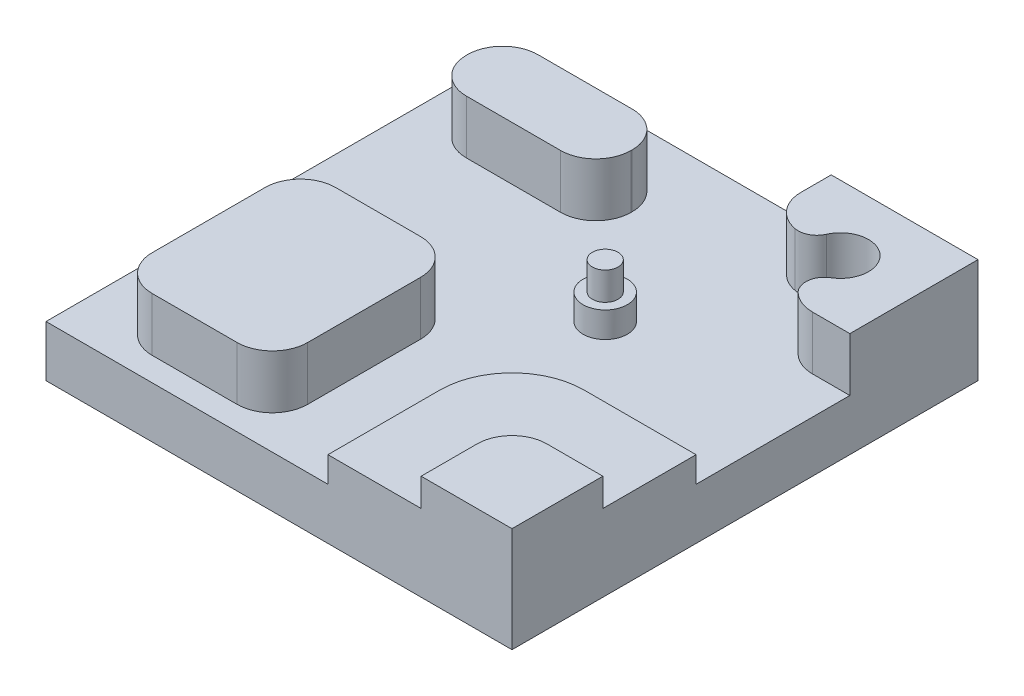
from build123d import *

# Parameters (mm, degrees)
SKETCH1_W           = 50
SKETCH1_H           = 50
BOSS_EXTRUDE1_DEPTH = 5.5
SKETCH2_W           = 9.75
SKETCH2_H           = 9.75
BOSS_EXTRUDE2_DEPTH = 5.75
SKETCH3_W           = 19.75
SKETCH3_H           = 19.75
BOSS_EXTRUDE3_DEPTH = 2.75
FILLET1_R           = 3.75
SKETCH4_W           = 15.75
SKETCH4_H           = 7
BOSS_EXTRUDE4_DEPTH = 5.75
SKETCH5_W           = 7.75
SKETCH5_H           = 6.75
BOSS_EXTRUDE5_DEPTH = 5.75
FILLET2_R           = 3.75
SKETCH6_W           = 16.69
SKETCH6_H           = 19.69
BOSS_EXTRUDE6_DEPTH = 5.75
FILLET3_R           = 3.79
SKETCH7_W           = 17.69
SKETCH7_H           = 7.69
BOSS_EXTRUDE7_DEPTH = 5.75
FILLET4_R           = 3.79
SKETCH8_R           = 2.375
BOSS_EXTRUDE8_DEPTH = 2.75
SKETCH9_R           = 1.375
BOSS_EXTRUDE9_DEPTH = 5.75
FILLET5_R           = 7.75
SKETCH10_R          = 3
CUT_EXTRUDE2_DEPTH  = 5.75
FILLET7_R           = 2


with BuildPart() as part:
    # Sketch1 → Boss-Extrude1 (new body)
    with BuildSketch(Plane(origin=(0, 0, 0), x_dir=(1, 0, 0), z_dir=(0, 1, 0))):
        Rectangle(SKETCH1_W, SKETCH1_H)
    extrude(amount=BOSS_EXTRUDE1_DEPTH)

    # Sketch2 → Boss-Extrude2 (add)
    with BuildSketch(Plane(origin=(0, 5.5, 0), x_dir=(1, 0, 0), z_dir=(0, 1, 0))):
        with Locations((20.125, -20.125)):
            Rectangle(SKETCH2_W, SKETCH2_H)
    extrude(amount=BOSS_EXTRUDE2_DEPTH)

    # Sketch3 → Boss-Extrude3 (add)
    with BuildSketch(Plane(origin=(0, 5.5, 0), x_dir=(1, 0, 0), z_dir=(0, 1, 0))):
        with Locations((15.125, -15.125)):
            Rectangle(SKETCH3_W, SKETCH3_H)
    extrude(amount=BOSS_EXTRUDE3_DEPTH)

    # Fillet1
    fillet1_edges = [part.edges().sort_by_distance(p)[0] for p in [
        (15.25, 9.75, 15.25),
    ]]
    fillet(fillet1_edges, radius=FILLET1_R)

    # Sketch4 → Boss-Extrude4 (add)
    with BuildSketch(Plane(origin=(0, 5.5, 0), x_dir=(1, 0, 0), z_dir=(0, 1, 0))):
        with Locations((17.125, 21.5)):
            Rectangle(SKETCH4_W, SKETCH4_H)
    extrude(amount=BOSS_EXTRUDE4_DEPTH)

    # Sketch5 → Boss-Extrude5 (add)
    with BuildSketch(Plane(origin=(0, 5.5, 0), x_dir=(1, 0, 0), z_dir=(0, 1, 0))):
        with Locations((21.125, 14.625)):
            Rectangle(SKETCH5_W, SKETCH5_H)
    extrude(amount=BOSS_EXTRUDE5_DEPTH)

    # Fillet2
    fillet2_edges = [part.edges().sort_by_distance(p)[0] for p in [
        (9.25, 8.375, -18),
        (17.25, 8.375, -11.25),
    ]]
    fillet(fillet2_edges, radius=FILLET2_R)

    # Sketch6 → Boss-Extrude6 (add)
    with BuildSketch(Plane(origin=(0, 5.5, 0), x_dir=(1, 0, 0), z_dir=(0, 1, 0))):
        with Locations((-11.605, -12.605)):
            Rectangle(SKETCH6_W, SKETCH6_H)
    extrude(amount=BOSS_EXTRUDE6_DEPTH)

    # Fillet3
    fillet3_edges = [part.edges().sort_by_distance(p)[0] for p in [
        (-3.26, 8.375, 22.45),
        (-3.26, 8.375, 2.76),
        (-19.95, 8.375, 2.76),
        (-19.95, 8.375, 22.45),
    ]]
    fillet(fillet3_edges, radius=FILLET3_R)

    # Sketch7 → Boss-Extrude7 (add)
    with BuildSketch(Plane(origin=(0, 5.5, 0), x_dir=(1, 0, 0), z_dir=(0, 1, 0))):
        with Locations((-12.595, 16.595)):
            Rectangle(SKETCH7_W, SKETCH7_H)
    extrude(amount=BOSS_EXTRUDE7_DEPTH)

    # Fillet4
    fillet4_edges = [part.edges().sort_by_distance(p)[0] for p in [
        (-21.44, 8.375, -20.44),
        (-21.44, 8.375, -12.75),
        (-3.75, 8.375, -12.75),
        (-3.75, 8.375, -20.44),
    ]]
    fillet(fillet4_edges, radius=FILLET4_R)

    # Sketch8 → Boss-Extrude8 (add)
    with BuildSketch(Plane(origin=(0, 5.5, 0), x_dir=(1, 0, 0), z_dir=(0, 1, 0))):
        with Locations(Location((5, 5, 0), (0, 0, 90))):
            Circle(SKETCH8_R)
    extrude(amount=BOSS_EXTRUDE8_DEPTH)

    # Sketch9 → Boss-Extrude9 (add)
    with BuildSketch(Plane(origin=(0, 5.5, 0), x_dir=(1, 0, 0), z_dir=(0, 1, 0))):
        with Locations(Location((5, 5, 0), (0, 0, 270))):
            Circle(SKETCH9_R)
    extrude(amount=BOSS_EXTRUDE9_DEPTH)

    # Fillet5
    fillet5_edges = [part.edges().sort_by_distance(p)[0] for p in [
        (5.25, 6.875, 5.25),
    ]]
    fillet(fillet5_edges, radius=FILLET5_R)

    # Sketch10 → Cut-Extrude2 (cut)
    with BuildSketch(Plane(origin=(0, 11.25, 0), x_dir=(1, 0, 0), z_dir=(0, 1, 0))):
        with Locations((17.25, 18)):
            Circle(SKETCH10_R)
    extrude(amount=-CUT_EXTRUDE2_DEPTH, mode=Mode.SUBTRACT)

    # Fillet7
    fillet7_edges = [part.edges().sort_by_distance(p)[0] for p in [
        (17.25, 8.375, -15),
        (14.25, 8.375, -18),
    ]]
    fillet(fillet7_edges, radius=FILLET7_R)


solid = part.part
